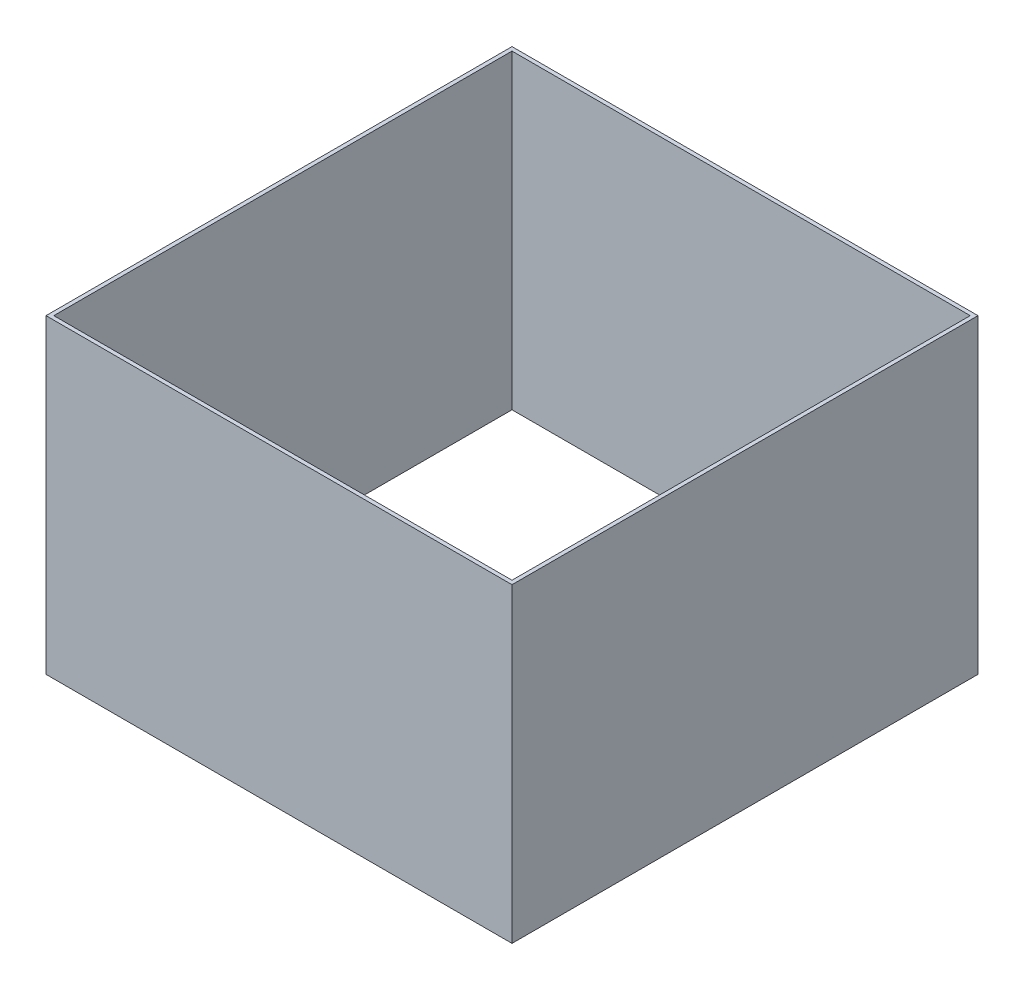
from build123d import *

# Parameters (mm, degrees)
SKETCH1_W           = 304.8
SKETCH1_H           = 304.8
SKETCH1_W_2         = 299.72
SKETCH1_H_2         = 299.72
BOSS_EXTRUDE1_DEPTH = 203.2


with BuildPart() as part:
    # Sketch1 → Boss-Extrude1 (new body)
    with BuildSketch(Plane(origin=(0, 0, 0), x_dir=(1, 0, 0), z_dir=(0, 1, 0))):
        Rectangle(SKETCH1_W, SKETCH1_H)
        Rectangle(SKETCH1_W_2, SKETCH1_H_2, mode=Mode.SUBTRACT)
    extrude(amount=BOSS_EXTRUDE1_DEPTH)


solid = part.part
